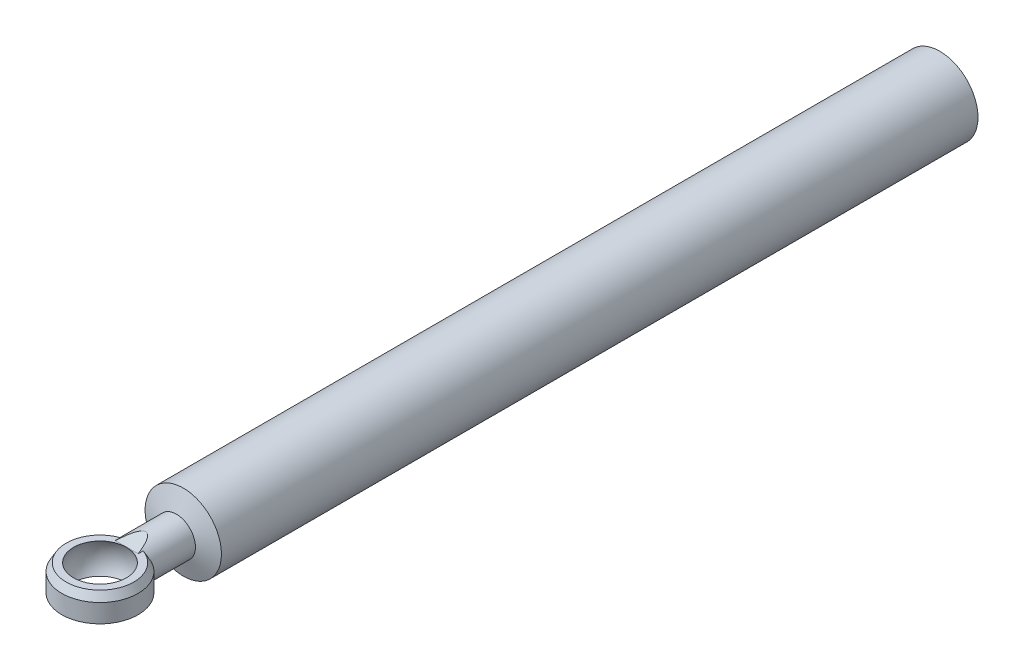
ISO-10303-21;
HEADER;
FILE_DESCRIPTION(('STEP AP214'),'2;1');
FILE_NAME('part.step','',(''),(''),'','','');
FILE_SCHEMA(('AUTOMOTIVE_DESIGN { 1 0 10303 214 1 1 1 1 }'));
ENDSEC;
DATA;
#1=APPLICATION_CONTEXT('core data for automotive mechanical design processes');
#2=APPLICATION_PROTOCOL_DEFINITION('international standard','automotive_design',2000,#1);
#3=PRODUCT_CONTEXT('',#1,'mechanical');
#4=PRODUCT('Part','Part','',(#3));
#5=PRODUCT_RELATED_PRODUCT_CATEGORY('part','',(#4));
#6=PRODUCT_DEFINITION_FORMATION('','',#4);
#7=PRODUCT_DEFINITION_CONTEXT('part definition',#1,'design');
#8=PRODUCT_DEFINITION('design','',#6,#7);
#9=PRODUCT_DEFINITION_SHAPE('','',#8);
#10=(LENGTH_UNIT() NAMED_UNIT(*) SI_UNIT(.MILLI.,.METRE.));
#11=(NAMED_UNIT(*) PLANE_ANGLE_UNIT() SI_UNIT($,.RADIAN.));
#12=(NAMED_UNIT(*) SI_UNIT($,.STERADIAN.) SOLID_ANGLE_UNIT());
#13=UNCERTAINTY_MEASURE_WITH_UNIT(LENGTH_MEASURE(1.E-05),#10,'distance_accuracy_value','');
#14=(GEOMETRIC_REPRESENTATION_CONTEXT(3) GLOBAL_UNCERTAINTY_ASSIGNED_CONTEXT((#13)) GLOBAL_UNIT_ASSIGNED_CONTEXT((#10,
#11,#12)) REPRESENTATION_CONTEXT('',''));
#15=CARTESIAN_POINT('',(0.,0.,0.));
#16=DIRECTION('',(0.,0.,1.));
#17=DIRECTION('',(1.,0.,0.));
#18=AXIS2_PLACEMENT_3D('',#15,#16,#17);
#19=CARTESIAN_POINT('',(-1.11022302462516E-13,4.,220.000000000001));
#20=DIRECTION('',(0.,1.,0.));
#21=DIRECTION('',(0.,0.,1.));
#22=AXIS2_PLACEMENT_3D('',#19,#20,#21);
#23=PLANE('',#22);
#24=CARTESIAN_POINT('',(-1.11022302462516E-13,4.,220.000000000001));
#25=DIRECTION('',(0.,1.,0.));
#26=DIRECTION('',(0.,0.,1.));
#27=AXIS2_PLACEMENT_3D('',#24,#25,#26);
#28=CIRCLE('',#27,8.84529946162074);
#29=CARTESIAN_POINT('',(-3.00000000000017,3.99999999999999,211.678983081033));
#30=VERTEX_POINT('',#29);
#31=CARTESIAN_POINT('',(3.00000000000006,4.,211.678983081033));
#32=VERTEX_POINT('',#31);
#33=EDGE_CURVE('E131',#30,#32,#28,.T.);
#34=ORIENTED_EDGE('',*,*,#33,.T.);
#35=DIRECTION('',(0.,0.,-1.));
#36=VECTOR('',#35,1.);
#37=CARTESIAN_POINT('',(2.99999999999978,4.,213.000000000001));
#38=LINE('',#37,#36);
#39=CARTESIAN_POINT('',(2.99999999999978,4.,213.000000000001));
#40=VERTEX_POINT('',#39);
#41=EDGE_CURVE('E110',#40,#32,#38,.T.);
#42=ORIENTED_EDGE('',*,*,#41,.F.);
#43=DIRECTION('',(-1.,0.,0.));
#44=VECTOR('',#43,1.);
#45=CARTESIAN_POINT('',(-1.11022302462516E-13,4.00000000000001,213.000000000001));
#46=LINE('',#45,#44);
#47=CARTESIAN_POINT('',(-3.00000000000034,3.99999999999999,213.));
#48=VERTEX_POINT('',#47);
#49=EDGE_CURVE('E95',#40,#48,#46,.T.);
#50=ORIENTED_EDGE('',*,*,#49,.T.);
#51=DIRECTION('',(0.,0.,-1.));
#52=VECTOR('',#51,1.);
#53=CARTESIAN_POINT('',(-3.00000000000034,3.99999999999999,213.));
#54=LINE('',#53,#52);
#55=EDGE_CURVE('E102',#30,#48,#54,.F.);
#56=ORIENTED_EDGE('',*,*,#55,.F.);
#57=EDGE_LOOP('',(#34,#42,#50,#56));
#58=FACE_BOUND('',#57,.T.);
#59=CARTESIAN_POINT('',(-1.11022302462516E-13,4.,220.000000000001));
#60=DIRECTION('',(0.,1.,0.));
#61=DIRECTION('',(0.,0.,1.));
#62=AXIS2_PLACEMENT_3D('',#59,#60,#61);
#63=CIRCLE('',#62,6.92820323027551);
#64=CARTESIAN_POINT('',(0.,4.,213.071796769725));
#65=VERTEX_POINT('',#64);
#66=EDGE_CURVE('E100',#65,#65,#63,.F.);
#67=ORIENTED_EDGE('',*,*,#66,.T.);
#68=EDGE_LOOP('',(#67));
#69=FACE_BOUND('',#68,.T.);
#70=ADVANCED_FACE('F31',(#58,#69),#23,.T.);
#71=CARTESIAN_POINT('',(1.11022302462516E-13,-4.,220.));
#72=DIRECTION('',(0.,1.,0.));
#73=DIRECTION('',(0.,0.,1.));
#74=AXIS2_PLACEMENT_3D('',#71,#72,#73);
#75=PLANE('',#74);
#76=CARTESIAN_POINT('',(1.11022302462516E-13,-4.,220.));
#77=DIRECTION('',(0.,1.,0.));
#78=DIRECTION('',(0.,0.,1.));
#79=AXIS2_PLACEMENT_3D('',#76,#77,#78);
#80=CIRCLE('',#79,8.00000000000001);
#81=CARTESIAN_POINT('',(3.00000000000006,-4.00000000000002,212.583801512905));
#82=VERTEX_POINT('',#81);
#83=CARTESIAN_POINT('',(-3.00000000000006,-3.99999999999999,212.583801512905));
#84=VERTEX_POINT('',#83);
#85=EDGE_CURVE('E47',#82,#84,#80,.F.);
#86=ORIENTED_EDGE('',*,*,#85,.T.);
#87=DIRECTION('',(0.,0.,-1.));
#88=VECTOR('',#87,1.);
#89=CARTESIAN_POINT('',(-2.99999999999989,-4.,213.000000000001));
#90=LINE('',#89,#88);
#91=CARTESIAN_POINT('',(-2.99999999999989,-4.,213.000000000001));
#92=VERTEX_POINT('',#91);
#93=EDGE_CURVE('E86',#84,#92,#90,.F.);
#94=ORIENTED_EDGE('',*,*,#93,.T.);
#95=DIRECTION('',(-1.,0.,0.));
#96=VECTOR('',#95,1.);
#97=CARTESIAN_POINT('',(1.66533453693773E-13,-3.99999999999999,213.000000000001));
#98=LINE('',#97,#96);
#99=CARTESIAN_POINT('',(2.99999999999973,-4.,213.000000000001));
#100=VERTEX_POINT('',#99);
#101=EDGE_CURVE('E93',#100,#92,#98,.T.);
#102=ORIENTED_EDGE('',*,*,#101,.F.);
#103=DIRECTION('',(0.,0.,-1.));
#104=VECTOR('',#103,1.);
#105=CARTESIAN_POINT('',(2.99999999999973,-4.,213.000000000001));
#106=LINE('',#105,#104);
#107=EDGE_CURVE('E88',#100,#82,#106,.T.);
#108=ORIENTED_EDGE('',*,*,#107,.T.);
#109=EDGE_LOOP('',(#86,#94,#102,#108));
#110=FACE_BOUND('',#109,.T.);
#111=CARTESIAN_POINT('',(1.11022302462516E-13,-4.,220.));
#112=DIRECTION('',(0.,1.,0.));
#113=DIRECTION('',(0.,0.,1.));
#114=AXIS2_PLACEMENT_3D('',#111,#112,#113);
#115=CIRCLE('',#114,6.92820323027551);
#116=CARTESIAN_POINT('',(0.,-4.,213.071796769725));
#117=VERTEX_POINT('',#116);
#118=EDGE_CURVE('E35',#117,#117,#115,.F.);
#119=ORIENTED_EDGE('',*,*,#118,.F.);
#120=EDGE_LOOP('',(#119));
#121=FACE_BOUND('',#120,.T.);
#122=ADVANCED_FACE('F98',(#110,#121),#75,.F.);
#123=CARTESIAN_POINT('',(-1.66533453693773E-13,0.,200.000000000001));
#124=DIRECTION('',(0.,0.,-1.));
#125=DIRECTION('',(-1.,0.,0.));
#126=AXIS2_PLACEMENT_3D('',#123,#124,#125);
#127=CYLINDRICAL_SURFACE('',#126,10.);
#128=CARTESIAN_POINT('',(0.,0.,198.18014882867));
#129=DIRECTION('',(0.,0.,1.));
#130=DIRECTION('',(1.,0.,0.));
#131=AXIS2_PLACEMENT_3D('',#128,#129,#130);
#132=CIRCLE('',#131,10.);
#133=CARTESIAN_POINT('',(9.99999999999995,0.,198.18014882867));
#134=VERTEX_POINT('',#133);
#135=EDGE_CURVE('E96',#134,#134,#132,.F.);
#136=ORIENTED_EDGE('',*,*,#135,.T.);
#137=EDGE_LOOP('',(#136));
#138=FACE_BOUND('',#137,.T.);
#139=CARTESIAN_POINT('',(0.,0.,0.));
#140=DIRECTION('',(0.,0.,1.));
#141=DIRECTION('',(1.,0.,0.));
#142=AXIS2_PLACEMENT_3D('',#139,#140,#141);
#143=CIRCLE('',#142,10.);
#144=CARTESIAN_POINT('',(10.,0.,0.));
#145=VERTEX_POINT('',#144);
#146=EDGE_CURVE('E116',#145,#145,#143,.T.);
#147=ORIENTED_EDGE('',*,*,#146,.T.);
#148=EDGE_LOOP('',(#147));
#149=FACE_BOUND('',#148,.T.);
#150=ADVANCED_FACE('F33',(#138,#149),#127,.T.);
#151=CARTESIAN_POINT('',(0.,0.,0.));
#152=DIRECTION('',(0.,0.,1.));
#153=DIRECTION('',(1.,0.,0.));
#154=AXIS2_PLACEMENT_3D('',#151,#152,#153);
#155=PLANE('',#154);
#156=ORIENTED_EDGE('',*,*,#146,.F.);
#157=EDGE_LOOP('',(#156));
#158=FACE_BOUND('',#157,.T.);
#159=ADVANCED_FACE('F148',(#158),#155,.F.);
#160=CARTESIAN_POINT('',(-1.11022302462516E-13,0.,213.000000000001));
#161=DIRECTION('',(0.,0.,-1.));
#162=DIRECTION('',(-1.,0.,0.));
#163=AXIS2_PLACEMENT_3D('',#160,#161,#162);
#164=CYLINDRICAL_SURFACE('',#163,5.);
#165=CARTESIAN_POINT('',(-2.22044604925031E-13,0.,233.000000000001));
#166=DIRECTION('',(0.,0.98058067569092,-0.196116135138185));
#167=DIRECTION('',(0.,-0.196116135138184,-0.980580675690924));
#168=AXIS2_PLACEMENT_3D('',#165,#166,#167);
#169=ELLIPSE('',#168,25.4950975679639,5.);
#170=EDGE_CURVE('E82',#100,#92,#169,.T.);
#171=ORIENTED_EDGE('',*,*,#170,.T.);
#172=ORIENTED_EDGE('',*,*,#93,.F.);
#173=CARTESIAN_POINT('',(-3.00000000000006,-3.99999999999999,212.583801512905));
#174=CARTESIAN_POINT('',(-3.06141518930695,-3.95393217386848,212.522582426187));
#175=CARTESIAN_POINT('',(-3.12064501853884,-3.90730690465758,212.459649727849));
#176=CARTESIAN_POINT('',(-3.23494374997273,-3.81321713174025,212.330782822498));
#177=CARTESIAN_POINT('',(-3.29001492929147,-3.76575310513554,212.264850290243));
#178=CARTESIAN_POINT('',(-3.44868855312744,-3.62308062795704,212.063990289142));
#179=CARTESIAN_POINT('',(-3.54656917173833,-3.52696621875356,211.925167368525));
#180=CARTESIAN_POINT('',(-3.72877947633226,-3.33374089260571,211.639830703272));
#181=CARTESIAN_POINT('',(-3.81311683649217,-3.2366305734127,211.493321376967));
#182=CARTESIAN_POINT('',(-3.93108170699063,-3.09039556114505,211.268651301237));
#183=CARTESIAN_POINT('',(-3.96909502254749,-3.04138700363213,211.192675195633));
#184=CARTESIAN_POINT('',(-4.04233000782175,-2.94334933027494,211.039427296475));
#185=CARTESIAN_POINT('',(-4.07755227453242,-2.89432022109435,210.962155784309));
#186=CARTESIAN_POINT('',(-4.11148038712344,-2.8452994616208,210.884314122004));
#187=B_SPLINE_CURVE_WITH_KNOTS('',3,(#173,#174,#175,#176,#177,#178,#179,#180,#181,#182,#183,
#184,#185,#186),.UNSPECIFIED.,.F.,.F.,(4,2,2,2,2,2,4),(0.,0.294478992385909,0.58879555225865,
1.17347314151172,1.75781824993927,2.05201049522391,2.34613964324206),.UNSPECIFIED.);
#188=CARTESIAN_POINT('',(-4.11148038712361,-2.84529946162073,210.884314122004));
#189=VERTEX_POINT('',#188);
#190=EDGE_CURVE('E11',#84,#189,#187,.T.);
#191=ORIENTED_EDGE('',*,*,#190,.T.);
#192=CARTESIAN_POINT('',(-4.99999999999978,0.,211.339745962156));
#193=CARTESIAN_POINT('',(-4.99999937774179,-0.130331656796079,211.339745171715));
#194=CARTESIAN_POINT('',(-4.99489703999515,-0.26067490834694,211.336793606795));
#195=CARTESIAN_POINT('',(-4.97455590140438,-0.520355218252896,211.325097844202));
#196=CARTESIAN_POINT('',(-4.95931238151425,-0.64969177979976,211.316350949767));
#197=CARTESIAN_POINT('',(-4.91885673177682,-0.906513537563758,211.293370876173));
#198=CARTESIAN_POINT('',(-4.89362896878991,-1.03399550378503,211.279129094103));
#199=CARTESIAN_POINT('',(-4.83352579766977,-1.28601746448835,211.245675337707));
#200=CARTESIAN_POINT('',(-4.79864619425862,-1.41055615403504,211.226461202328));
#201=CARTESIAN_POINT('',(-4.68053466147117,-1.77711120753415,211.162543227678));
#202=CARTESIAN_POINT('',(-4.58356144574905,-2.01373232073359,211.111401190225));
#203=CARTESIAN_POINT('',(-4.35632594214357,-2.46716195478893,210.997863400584));
#204=CARTESIAN_POINT('',(-4.22606185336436,-2.68396940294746,210.935467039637));
#205=CARTESIAN_POINT('',(-3.92334549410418,-3.11151061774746,210.800159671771));
#206=CARTESIAN_POINT('',(-3.74829976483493,-3.32026858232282,210.726805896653));
#207=CARTESIAN_POINT('',(-3.36622943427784,-3.70706905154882,210.581391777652));
#208=CARTESIAN_POINT('',(-3.15918897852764,-3.88509623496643,210.509332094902));
#209=CARTESIAN_POINT('',(-2.82033206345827,-4.13122642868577,210.40515556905));
#210=CARTESIAN_POINT('',(-2.69838192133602,-4.21191315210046,210.370064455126));
#211=CARTESIAN_POINT('',(-2.4472213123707,-4.36262866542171,210.30319843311));
#212=CARTESIAN_POINT('',(-2.31801376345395,-4.43266169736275,210.271422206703));
#213=CARTESIAN_POINT('',(-2.05317391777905,-4.56137623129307,210.212104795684));
#214=CARTESIAN_POINT('',(-1.91754328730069,-4.62006065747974,210.184562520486));
#215=CARTESIAN_POINT('',(-1.64079696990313,-4.72543101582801,210.13452757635));
#216=CARTESIAN_POINT('',(-1.49968186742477,-4.77211822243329,210.11203437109));
#217=CARTESIAN_POINT('',(-1.22330436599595,-4.85001551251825,210.074196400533));
#218=CARTESIAN_POINT('',(-1.08833937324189,-4.88209010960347,210.058457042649));
#219=CARTESIAN_POINT('',(-0.815709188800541,-4.93496642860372,210.032384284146));
#220=CARTESIAN_POINT('',(-0.678044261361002,-4.95576924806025,210.022050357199));
#221=CARTESIAN_POINT('',(-0.401217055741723,-4.98581991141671,210.007090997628));
#222=CARTESIAN_POINT('',(-0.262055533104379,-4.99507333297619,210.002462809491));
#223=CARTESIAN_POINT('',(0.0166220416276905,-5.00191433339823,209.999043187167));
#224=CARTESIAN_POINT('',(0.156138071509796,-4.99950262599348,210.000251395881));
#225=CARTESIAN_POINT('',(0.422158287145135,-4.98376939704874,210.008107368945));
#226=CARTESIAN_POINT('',(0.54873556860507,-4.97141822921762,210.014271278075));
#227=CARTESIAN_POINT('',(0.800312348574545,-4.93716742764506,210.03127884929));
#228=CARTESIAN_POINT('',(0.925311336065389,-4.915264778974,210.042123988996));
#229=CARTESIAN_POINT('',(1.17280363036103,-4.86215377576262,210.068232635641));
#230=CARTESIAN_POINT('',(1.29529776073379,-4.83094853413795,210.08349466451));
#231=CARTESIAN_POINT('',(1.53706747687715,-4.7595523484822,210.118078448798));
#232=CARTESIAN_POINT('',(1.65634181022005,-4.71935796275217,210.137401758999));
#233=CARTESIAN_POINT('',(2.01140340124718,-4.58462546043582,210.201407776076));
#234=CARTESIAN_POINT('',(2.24122720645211,-4.47663104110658,210.251773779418));
#235=CARTESIAN_POINT('',(2.67992393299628,-4.22867030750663,210.363121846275));
#236=CARTESIAN_POINT('',(2.88878931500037,-4.088692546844,210.424107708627));
#237=CARTESIAN_POINT('',(3.30085071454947,-3.76553652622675,210.557776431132));
#238=CARTESIAN_POINT('',(3.50164452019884,-3.57952539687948,210.631020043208));
#239=CARTESIAN_POINT('',(3.8705477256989,-3.17701080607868,210.77729413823));
#240=CARTESIAN_POINT('',(4.03863197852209,-2.96048410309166,210.850324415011));
#241=CARTESIAN_POINT('',(4.26795395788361,-2.60880646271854,210.956090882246));
#242=CARTESIAN_POINT('',(4.34240098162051,-2.48294906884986,210.991700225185));
#243=CARTESIAN_POINT('',(4.48030007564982,-2.22448612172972,211.059485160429));
#244=CARTESIAN_POINT('',(4.54375677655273,-2.09188344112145,211.091662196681));
#245=CARTESIAN_POINT('',(4.65901104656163,-1.82079650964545,211.151393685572));
#246=CARTESIAN_POINT('',(4.71081567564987,-1.68231588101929,211.178950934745));
#247=CARTESIAN_POINT('',(4.80217514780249,-1.40037865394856,211.228351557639));
#248=CARTESIAN_POINT('',(4.84173166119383,-1.25692273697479,211.250195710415));
#249=CARTESIAN_POINT('',(4.90539138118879,-0.9777430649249,211.285738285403));
#250=CARTESIAN_POINT('',(4.9304700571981,-0.842306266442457,211.299944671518));
#251=CARTESIAN_POINT('',(4.96939299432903,-0.569328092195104,211.322117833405));
#252=CARTESIAN_POINT('',(4.98323863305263,-0.431786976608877,211.330085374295));
#253=CARTESIAN_POINT('',(4.99947854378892,-0.155884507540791,211.339439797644));
#254=CARTESIAN_POINT('',(5.00187935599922,-0.0175236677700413,211.340830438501));
#255=CARTESIAN_POINT('',(4.99520900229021,0.258820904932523,211.336980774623));
#256=CARTESIAN_POINT('',(4.98613861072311,0.396804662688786,211.331740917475));
#257=CARTESIAN_POINT('',(4.95828928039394,0.656088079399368,211.315784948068));
#258=CARTESIAN_POINT('',(4.94068517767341,0.777556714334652,211.305733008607));
#259=CARTESIAN_POINT('',(4.89671673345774,1.01841757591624,211.28089501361));
#260=CARTESIAN_POINT('',(4.87034969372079,1.13780915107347,211.266107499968));
#261=CARTESIAN_POINT('',(4.77850297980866,1.49171004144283,211.215303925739));
#262=CARTESIAN_POINT('',(4.70025914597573,1.72211429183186,211.172835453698));
#263=CARTESIAN_POINT('',(4.50823244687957,2.17709323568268,211.073187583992));
#264=CARTESIAN_POINT('',(4.39297142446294,2.4009036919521,211.015417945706));
#265=CARTESIAN_POINT('',(4.13143421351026,2.82733774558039,210.892193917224));
#266=CARTESIAN_POINT('',(3.98514209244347,3.02995037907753,210.826735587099));
#267=CARTESIAN_POINT('',(3.64419701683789,3.43489140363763,210.685602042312));
#268=CARTESIAN_POINT('',(3.44577250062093,3.63396448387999,210.60967906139));
#269=CARTESIAN_POINT('',(3.01697632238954,3.99708246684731,210.463280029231));
#270=CARTESIAN_POINT('',(2.7865939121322,4.16111553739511,210.392805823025));
#271=CARTESIAN_POINT('',(2.41774074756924,4.37900947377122,210.295805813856));
#272=CARTESIAN_POINT('',(2.28903769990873,4.44766209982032,210.264570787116));
#273=CARTESIAN_POINT('',(2.02535752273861,4.57375651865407,210.20632288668));
#274=CARTESIAN_POINT('',(1.89038320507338,4.63120327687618,210.179308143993));
#275=CARTESIAN_POINT('',(1.61516754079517,4.73421790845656,210.13031059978));
#276=CARTESIAN_POINT('',(1.47492874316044,4.77979144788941,210.108325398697));
#277=CARTESIAN_POINT('',(1.19024723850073,4.85850907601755,210.070049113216));
#278=CARTESIAN_POINT('',(1.04580503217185,4.89165463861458,210.053757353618));
#279=CARTESIAN_POINT('',(0.767401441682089,4.94259503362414,210.028600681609));
#280=CARTESIAN_POINT('',(0.633694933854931,4.96151960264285,210.019191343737));
#281=CARTESIAN_POINT('',(0.364924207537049,4.98849345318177,210.005755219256));
#282=CARTESIAN_POINT('',(0.229860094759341,4.99654357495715,210.001728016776));
#283=CARTESIAN_POINT('',(-0.0404881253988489,5.00166317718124,209.999168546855));
#284=CARTESIAN_POINT('',(-0.175772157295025,4.99873585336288,210.000634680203));
#285=CARTESIAN_POINT('',(-0.44548523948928,4.98194745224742,210.00901666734));
#286=CARTESIAN_POINT('',(-0.579914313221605,4.9680866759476,210.015932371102));
#287=CARTESIAN_POINT('',(-0.838004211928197,4.93088232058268,210.03439129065));
#288=CARTESIAN_POINT('',(-0.961788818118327,4.90822716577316,210.045597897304));
#289=CARTESIAN_POINT('',(-1.20687032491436,4.85378684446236,210.072326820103));
#290=CARTESIAN_POINT('',(-1.32816642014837,4.82199877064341,210.08785051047));
#291=CARTESIAN_POINT('',(-1.68709586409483,4.71339175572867,210.140387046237));
#292=CARTESIAN_POINT('',(-1.91998814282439,4.62329807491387,210.183381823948));
#293=CARTESIAN_POINT('',(-2.37715486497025,4.40635777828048,210.283705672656));
#294=CARTESIAN_POINT('',(-2.60063468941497,4.27810403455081,210.341569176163));
#295=CARTESIAN_POINT('',(-3.02386422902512,3.99020969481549,210.465593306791));
#296=CARTESIAN_POINT('',(-3.22360297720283,3.83055468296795,210.531757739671));
#297=CARTESIAN_POINT('',(-3.61456788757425,3.4660248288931,210.673567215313));
#298=CARTESIAN_POINT('',(-3.80296860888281,3.25823096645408,210.749500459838));
#299=CARTESIAN_POINT('',(-4.14333626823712,2.81270295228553,210.896855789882));
#300=CARTESIAN_POINT('',(-4.29527097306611,2.57494259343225,210.968273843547));
#301=CARTESIAN_POINT('',(-4.49442606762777,2.19578033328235,211.066587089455));
#302=CARTESIAN_POINT('',(-4.5567568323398,2.06337367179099,211.098313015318));
#303=CARTESIAN_POINT('',(-4.66985426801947,1.79274453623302,211.157120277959));
#304=CARTESIAN_POINT('',(-4.72062689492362,1.65452510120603,211.184204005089));
#305=CARTESIAN_POINT('',(-4.80987708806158,1.3735921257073,211.232579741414));
#306=CARTESIAN_POINT('',(-4.84838628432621,1.23089120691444,211.253886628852));
#307=CARTESIAN_POINT('',(-4.91270711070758,0.941907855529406,211.28985215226));
#308=CARTESIAN_POINT('',(-4.93852761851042,0.795628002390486,211.304515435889));
#309=CARTESIAN_POINT('',(-4.97182308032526,0.541002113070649,211.323524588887));
#310=CARTESIAN_POINT('',(-4.98237929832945,0.433175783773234,211.329592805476));
#311=CARTESIAN_POINT('',(-4.99646825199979,0.216902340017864,211.337703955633));
#312=CARTESIAN_POINT('',(-5.00000051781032,0.108455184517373,211.33974661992));
#313=CARTESIAN_POINT('',(-4.99999999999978,0.,211.339745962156));
#314=B_SPLINE_CURVE_WITH_KNOTS('',3,(#192,#193,#194,#195,#196,#197,#198,#199,#200,#201,#202,
#203,#204,#205,#206,#207,#208,#209,#210,#211,#212,#213,#214,#215,#216,#217,#218,#219,#220,#221,
#222,#223,#224,#225,#226,#227,#228,#229,#230,#231,#232,#233,#234,#235,#236,#237,#238,#239,#240,
#241,#242,#243,#244,#245,#246,#247,#248,#249,#250,#251,#252,#253,#254,#255,#256,#257,#258,#259,
#260,#261,#262,#263,#264,#265,#266,#267,#268,#269,#270,#271,#272,#273,#274,#275,#276,#277,#278,
#279,#280,#281,#282,#283,#284,#285,#286,#287,#288,#289,#290,#291,#292,#293,#294,#295,#296,#297,
#298,#299,#300,#301,#302,#303,#304,#305,#306,#307,#308,#309,#310,#311,#312,#313),.UNSPECIFIED.,
.T.,.F.,(4,2,2,2,2,2,2,2,2,2,2,2,2,2,2,2,2,2,2,2,2,2,2,2,2,2,2,2,2,2,2,2,2,2,2,2,2,2,2,2,2,2,2,
2,2,2,2,2,2,2,2,2,2,2,2,2,2,2,2,2,4),(0.,0.39088238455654,0.781946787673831,1.17362595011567,
1.56547562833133,2.34415414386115,3.12287479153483,3.96582272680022,4.8091897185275,
5.25982992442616,5.71029022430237,6.1606342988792,6.61093051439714,7.02920538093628,
7.44743951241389,7.86547158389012,8.28347807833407,8.66500933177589,9.04666110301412,
9.42818530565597,9.80985583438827,10.5829669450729,11.3563551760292,12.202849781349,
13.0499926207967,13.5010020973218,13.9518210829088,14.4023661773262,14.8528498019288,
15.2676702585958,15.6824398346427,16.0969723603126,16.5114769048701,16.8804871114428,
17.2496110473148,17.9873544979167,18.7592666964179,19.531576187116,20.4012390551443,
21.2711951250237,21.7182117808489,22.1650299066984,22.6116344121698,23.0581859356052,
23.4637505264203,23.8692837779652,24.2746989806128,24.6801030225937,25.0586722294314,
25.4373620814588,26.1940875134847,26.9831783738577,27.77263234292,28.6406529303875,
29.509437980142,29.9581473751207,30.4066250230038,30.8539364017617,31.3009343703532,
31.626184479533,31.9514563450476),.UNSPECIFIED.);
#315=CARTESIAN_POINT('',(-4.58257569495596,1.99999999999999,211.111805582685));
#316=VERTEX_POINT('',#315);
#317=EDGE_CURVE('E123',#316,#189,#314,.T.);
#318=ORIENTED_EDGE('',*,*,#317,.F.);
#319=CARTESIAN_POINT('',(-4.58257569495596,1.99999999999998,211.111805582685));
#320=CARTESIAN_POINT('',(-4.53414774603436,2.11101340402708,211.15897430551));
#321=CARTESIAN_POINT('',(-4.48120318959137,2.22127150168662,211.203350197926));
#322=CARTESIAN_POINT('',(-4.36633843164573,2.43930863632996,211.286338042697));
#323=CARTESIAN_POINT('',(-4.30441476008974,2.5470866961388,211.3249477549));
#324=CARTESIAN_POINT('',(-4.17330081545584,2.75652976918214,211.395321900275));
#325=CARTESIAN_POINT('',(-4.10432386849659,2.85827970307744,211.427229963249));
#326=CARTESIAN_POINT('',(-3.95824430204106,3.05737702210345,211.485404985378));
#327=CARTESIAN_POINT('',(-3.88114481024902,3.15472608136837,211.51167410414));
#328=CARTESIAN_POINT('',(-3.68315376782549,3.38625323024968,211.569313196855));
#329=CARTESIAN_POINT('',(-3.55801951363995,3.51758861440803,211.597767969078));
#330=CARTESIAN_POINT('',(-3.35833335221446,3.70542654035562,211.633288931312));
#331=CARTESIAN_POINT('',(-3.28909650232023,3.76702189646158,211.643998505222));
#332=CARTESIAN_POINT('',(-3.14712017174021,3.88641621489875,211.663135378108));
#333=CARTESIAN_POINT('',(-3.07438065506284,3.94421513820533,211.671562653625));
#334=CARTESIAN_POINT('',(-3.00000000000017,3.99999999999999,211.678983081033));
#335=B_SPLINE_CURVE_WITH_KNOTS('',3,(#319,#320,#321,#322,#323,#324,#325,#326,#327,#328,#329,
#330,#331,#332,#333,#334),.UNSPECIFIED.,.F.,.F.,(4,2,2,2,2,2,2,4),(0.,0.389859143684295,
0.77986935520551,1.16039539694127,1.5407754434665,2.0900732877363,2.36979131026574,
2.64951220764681),.UNSPECIFIED.);
#336=EDGE_CURVE('E176',#316,#30,#335,.T.);
#337=ORIENTED_EDGE('',*,*,#336,.T.);
#338=ORIENTED_EDGE('',*,*,#55,.T.);
#339=CARTESIAN_POINT('',(-2.22044604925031E-13,0.,233.000000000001));
#340=DIRECTION('',(0.,-0.980580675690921,-0.196116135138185));
#341=DIRECTION('',(0.,0.196116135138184,-0.980580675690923));
#342=AXIS2_PLACEMENT_3D('',#339,#340,#341);
#343=ELLIPSE('',#342,25.4950975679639,5.);
#344=EDGE_CURVE('E91',#48,#40,#343,.T.);
#345=ORIENTED_EDGE('',*,*,#344,.T.);
#346=ORIENTED_EDGE('',*,*,#41,.T.);
#347=CARTESIAN_POINT('',(3.00000000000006,4.,211.678983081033));
#348=CARTESIAN_POINT('',(3.10367242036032,3.92227591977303,211.66866044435));
#349=CARTESIAN_POINT('',(3.20417957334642,3.84057047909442,211.656344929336));
#350=CARTESIAN_POINT('',(3.39823136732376,3.66996676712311,211.627084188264));
#351=CARTESIAN_POINT('',(3.49177349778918,3.58106592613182,211.610137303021));
#352=CARTESIAN_POINT('',(3.66900516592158,3.39913880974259,211.571452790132));
#353=CARTESIAN_POINT('',(3.75287905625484,3.30626554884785,211.549841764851));
#354=CARTESIAN_POINT('',(3.91276888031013,3.11540414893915,211.501217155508));
#355=CARTESIAN_POINT('',(3.98878781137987,3.0174179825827,211.474205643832));
#356=CARTESIAN_POINT('',(4.16459911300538,2.77268094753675,211.401237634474));
#357=CARTESIAN_POINT('',(4.25995091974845,2.62360381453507,211.352195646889));
#358=CARTESIAN_POINT('',(4.39034280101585,2.39433533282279,211.269362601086));
#359=CARTESIAN_POINT('',(4.43201590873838,2.3162433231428,211.239899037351));
#360=CARTESIAN_POINT('',(4.51074804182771,2.15890728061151,211.178033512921));
#361=CARTESIAN_POINT('',(4.54780719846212,2.07966328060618,211.145631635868));
#362=CARTESIAN_POINT('',(4.58257569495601,1.99999999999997,211.111805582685));
#363=B_SPLINE_CURVE_WITH_KNOTS('',3,(#347,#348,#349,#350,#351,#352,#353,#354,#355,#356,#357,
#358,#359,#360,#361,#362),.UNSPECIFIED.,.F.,.F.,(4,2,2,2,2,2,2,4),(0.,0.389857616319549,
0.779855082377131,1.1603630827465,1.54072534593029,2.09005455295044,2.36978652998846,
2.64951054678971),.UNSPECIFIED.);
#364=CARTESIAN_POINT('',(4.58257569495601,1.99999999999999,211.111805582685));
#365=VERTEX_POINT('',#364);
#366=EDGE_CURVE('E177',#32,#365,#363,.T.);
#367=ORIENTED_EDGE('',*,*,#366,.T.);
#368=CARTESIAN_POINT('',(4.11148038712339,-2.84529946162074,210.884314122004));
#369=VERTEX_POINT('',#368);
#370=EDGE_CURVE('E130',#369,#365,#314,.T.);
#371=ORIENTED_EDGE('',*,*,#370,.F.);
#372=CARTESIAN_POINT('',(4.11148038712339,-2.84529946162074,210.884314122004));
#373=CARTESIAN_POINT('',(4.07755227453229,-2.89432022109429,210.962155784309));
#374=CARTESIAN_POINT('',(4.04233000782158,-2.94334933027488,211.039427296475));
#375=CARTESIAN_POINT('',(3.9690950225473,-3.04138700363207,211.192675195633));
#376=CARTESIAN_POINT('',(3.93108170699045,-3.09039556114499,211.268651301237));
#377=CARTESIAN_POINT('',(3.81311683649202,-3.23663057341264,211.493321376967));
#378=CARTESIAN_POINT('',(3.7287794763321,-3.33374089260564,211.639830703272));
#379=CARTESIAN_POINT('',(3.54656917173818,-3.52696621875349,211.925167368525));
#380=CARTESIAN_POINT('',(3.4486885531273,-3.62308062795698,212.063990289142));
#381=CARTESIAN_POINT('',(3.29001492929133,-3.76575310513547,212.264850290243));
#382=CARTESIAN_POINT('',(3.23494374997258,-3.81321713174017,212.330782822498));
#383=CARTESIAN_POINT('',(3.12064501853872,-3.90730690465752,212.459649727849));
#384=CARTESIAN_POINT('',(3.06141518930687,-3.95393217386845,212.522582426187));
#385=CARTESIAN_POINT('',(3.00000000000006,-4.00000000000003,212.583801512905));
#386=B_SPLINE_CURVE_WITH_KNOTS('',3,(#372,#373,#374,#375,#376,#377,#378,#379,#380,#381,#382,
#383,#384,#385),.UNSPECIFIED.,.F.,.F.,(4,2,2,2,2,2,4),(0.,0.294129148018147,0.588321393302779,
1.17266650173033,1.75734409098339,2.05166065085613,2.34613964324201),.UNSPECIFIED.);
#387=EDGE_CURVE('E40',#369,#82,#386,.T.);
#388=ORIENTED_EDGE('',*,*,#387,.T.);
#389=ORIENTED_EDGE('',*,*,#107,.F.);
#390=EDGE_LOOP('',(#171,#172,#191,#318,#337,#338,#345,#346,#367,#371,#388,#389));
#391=FACE_BOUND('',#390,.T.);
#392=CARTESIAN_POINT('',(-1.66533453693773E-13,0.,200.000000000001));
#393=DIRECTION('',(0.,0.,1.));
#394=DIRECTION('',(1.,0.,0.));
#395=AXIS2_PLACEMENT_3D('',#392,#393,#394);
#396=CIRCLE('',#395,5.);
#397=CARTESIAN_POINT('',(4.99999999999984,0.,200.000000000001));
#398=VERTEX_POINT('',#397);
#399=EDGE_CURVE('E113',#398,#398,#396,.T.);
#400=ORIENTED_EDGE('',*,*,#399,.T.);
#401=EDGE_LOOP('',(#400));
#402=FACE_BOUND('',#401,.T.);
#403=ADVANCED_FACE('F84',(#391,#402),#164,.T.);
#404=CARTESIAN_POINT('',(-1.66533453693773E-13,0.,200.000000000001));
#405=DIRECTION('',(0.,0.,-1.));
#406=DIRECTION('',(-1.,0.,0.));
#407=AXIS2_PLACEMENT_3D('',#404,#405,#406);
#408=CONICAL_SURFACE('',#407,4.99999999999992,1.22173047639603);
#409=ORIENTED_EDGE('',*,*,#135,.F.);
#410=EDGE_LOOP('',(#409));
#411=FACE_BOUND('',#410,.T.);
#412=ORIENTED_EDGE('',*,*,#399,.F.);
#413=EDGE_LOOP('',(#412));
#414=FACE_BOUND('',#413,.T.);
#415=ADVANCED_FACE('F140',(#411,#414),#408,.T.);
#416=CARTESIAN_POINT('',(-1.11022302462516E-13,4.,220.000000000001));
#417=DIRECTION('',(0.,-1.,0.));
#418=DIRECTION('',(0.,0.,-1.));
#419=AXIS2_PLACEMENT_3D('',#416,#417,#418);
#420=CYLINDRICAL_SURFACE('',#419,10.);
#421=ORIENTED_EDGE('',*,*,#370,.T.);
#422=CARTESIAN_POINT('',(-1.11022302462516E-13,2.00000000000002,220.));
#423=DIRECTION('',(0.,1.,0.));
#424=DIRECTION('',(0.,0.,1.));
#425=AXIS2_PLACEMENT_3D('',#422,#423,#424);
#426=CIRCLE('',#425,10.);
#427=EDGE_CURVE('E180',#365,#316,#426,.F.);
#428=ORIENTED_EDGE('',*,*,#427,.T.);
#429=ORIENTED_EDGE('',*,*,#317,.T.);
#430=CARTESIAN_POINT('',(-2.22044604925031E-13,-2.84529946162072,220.000000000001));
#431=DIRECTION('',(0.,1.,0.));
#432=DIRECTION('',(0.,0.,1.));
#433=AXIS2_PLACEMENT_3D('',#430,#431,#432);
#434=CIRCLE('',#433,10.);
#435=EDGE_CURVE('E178',#189,#369,#434,.T.);
#436=ORIENTED_EDGE('',*,*,#435,.T.);
#437=EDGE_LOOP('',(#421,#428,#429,#436));
#438=FACE_BOUND('',#437,.T.);
#439=ADVANCED_FACE('F135',(#438),#420,.T.);
#440=CARTESIAN_POINT('',(-1.11022302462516E-13,4.,220.000000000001));
#441=DIRECTION('',(0.,-1.,0.));
#442=DIRECTION('',(0.,0.,-1.));
#443=AXIS2_PLACEMENT_3D('',#440,#441,#442);
#444=CONICAL_SURFACE('',#443,8.84529946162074,0.523598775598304);
#445=ORIENTED_EDGE('',*,*,#336,.F.);
#446=ORIENTED_EDGE('',*,*,#427,.F.);
#447=ORIENTED_EDGE('',*,*,#366,.F.);
#448=ORIENTED_EDGE('',*,*,#33,.F.);
#449=EDGE_LOOP('',(#445,#446,#447,#448));
#450=FACE_BOUND('',#449,.T.);
#451=ADVANCED_FACE('F139',(#450),#444,.T.);
#452=CARTESIAN_POINT('',(-2.22044604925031E-13,-2.84529946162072,220.000000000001));
#453=DIRECTION('',(0.,1.,0.));
#454=DIRECTION('',(0.,0.,1.));
#455=AXIS2_PLACEMENT_3D('',#452,#453,#454);
#456=CONICAL_SURFACE('',#455,10.,1.0471975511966);
#457=ORIENTED_EDGE('',*,*,#190,.F.);
#458=ORIENTED_EDGE('',*,*,#85,.F.);
#459=ORIENTED_EDGE('',*,*,#387,.F.);
#460=ORIENTED_EDGE('',*,*,#435,.F.);
#461=EDGE_LOOP('',(#457,#458,#459,#460));
#462=FACE_BOUND('',#461,.T.);
#463=ADVANCED_FACE('F167',(#462),#456,.T.);
#464=CARTESIAN_POINT('',(0.,0.,220.000000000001));
#465=DIRECTION('',(0.,1.,0.));
#466=DIRECTION('',(0.,0.,-1.));
#467=AXIS2_PLACEMENT_3D('',#464,#465,#466);
#468=SPHERICAL_SURFACE('',#467,8.);
#469=CARTESIAN_POINT('',(0.,4.,213.071796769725));
#470=CARTESIAN_POINT('',(0.,3.92442528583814,213.028163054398));
#471=CARTESIAN_POINT('',(0.,3.84813611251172,212.985766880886));
#472=CARTESIAN_POINT('',(0.,3.69421167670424,212.903492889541));
#473=CARTESIAN_POINT('',(0.,3.61657641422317,212.863615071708));
#474=CARTESIAN_POINT('',(0.,3.46004262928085,212.78642106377));
#475=CARTESIAN_POINT('',(0.,3.38114410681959,212.749104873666));
#476=CARTESIAN_POINT('',(0.,3.22216837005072,212.677073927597));
#477=CARTESIAN_POINT('',(0.,3.1420911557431,212.642359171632));
#478=CARTESIAN_POINT('',(0.,2.98084376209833,212.575568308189));
#479=CARTESIAN_POINT('',(0.,2.89967358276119,212.54349220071));
#480=CARTESIAN_POINT('',(0.,2.73632718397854,212.482012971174));
#481=CARTESIAN_POINT('',(0.,2.65415096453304,212.452609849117));
#482=CARTESIAN_POINT('',(0.,2.48888048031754,212.396508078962));
#483=CARTESIAN_POINT('',(0.,2.40578621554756,212.369809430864));
#484=CARTESIAN_POINT('',(0.,2.23876862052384,212.319145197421));
#485=CARTESIAN_POINT('',(0.,2.1548452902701,212.295179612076));
#486=CARTESIAN_POINT('',(0.,1.98625943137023,212.250007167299));
#487=CARTESIAN_POINT('',(0.,1.90159690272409,212.228800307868));
#488=CARTESIAN_POINT('',(0.,1.73162330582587,212.189168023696));
#489=CARTESIAN_POINT('',(0.,1.64631223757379,212.170742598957));
#490=CARTESIAN_POINT('',(0.,1.47513291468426,212.136692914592));
#491=CARTESIAN_POINT('',(0.,1.38926466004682,212.121068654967));
#492=CARTESIAN_POINT('',(0.,1.21706291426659,212.092638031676));
#493=CARTESIAN_POINT('',(0.,1.1307294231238,212.079831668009));
#494=CARTESIAN_POINT('',(0.,0.957689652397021,212.057050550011));
#495=CARTESIAN_POINT('',(0.,0.87098337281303,212.047075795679));
#496=CARTESIAN_POINT('',(0.,0.697290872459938,212.029968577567));
#497=CARTESIAN_POINT('',(0.,0.610304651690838,212.022836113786));
#498=CARTESIAN_POINT('',(0.,0.436145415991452,212.011421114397));
#499=CARTESIAN_POINT('',(0.,0.348972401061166,212.007138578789));
#500=CARTESIAN_POINT('',(0.,0.174532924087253,212.00142802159));
#501=CARTESIAN_POINT('',(0.,0.087266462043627,212.000000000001));
#502=CARTESIAN_POINT('',(0.,-0.0872664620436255,212.000000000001));
#503=CARTESIAN_POINT('',(0.,-0.174532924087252,212.00142802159));
#504=CARTESIAN_POINT('',(0.,-0.348972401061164,212.007138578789));
#505=CARTESIAN_POINT('',(0.,-0.43614541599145,212.011421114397));
#506=CARTESIAN_POINT('',(0.,-0.610304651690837,212.022836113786));
#507=CARTESIAN_POINT('',(0.,-0.697290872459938,212.029968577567));
#508=CARTESIAN_POINT('',(0.,-0.870983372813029,212.047075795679));
#509=CARTESIAN_POINT('',(0.,-0.95768965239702,212.057050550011));
#510=CARTESIAN_POINT('',(0.,-1.1307294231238,212.079831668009));
#511=CARTESIAN_POINT('',(0.,-1.21706291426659,212.092638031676));
#512=CARTESIAN_POINT('',(0.,-1.38926466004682,212.121068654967));
#513=CARTESIAN_POINT('',(0.,-1.47513291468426,212.136692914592));
#514=CARTESIAN_POINT('',(0.,-1.64631223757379,212.170742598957));
#515=CARTESIAN_POINT('',(0.,-1.73162330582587,212.189168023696));
#516=CARTESIAN_POINT('',(0.,-1.90159690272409,212.228800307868));
#517=CARTESIAN_POINT('',(0.,-1.98625943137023,212.250007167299));
#518=CARTESIAN_POINT('',(0.,-2.1548452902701,212.295179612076));
#519=CARTESIAN_POINT('',(0.,-2.23876862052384,212.319145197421));
#520=CARTESIAN_POINT('',(0.,-2.40578621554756,212.369809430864));
#521=CARTESIAN_POINT('',(0.,-2.48888048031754,212.396508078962));
#522=CARTESIAN_POINT('',(0.,-2.65415096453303,212.452609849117));
#523=CARTESIAN_POINT('',(0.,-2.73632718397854,212.482012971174));
#524=CARTESIAN_POINT('',(0.,-2.89967358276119,212.54349220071));
#525=CARTESIAN_POINT('',(0.,-2.98084376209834,212.575568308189));
#526=CARTESIAN_POINT('',(0.,-3.1420911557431,212.642359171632));
#527=CARTESIAN_POINT('',(0.,-3.22216837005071,212.677073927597));
#528=CARTESIAN_POINT('',(0.,-3.38114410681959,212.749104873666));
#529=CARTESIAN_POINT('',(0.,-3.46004262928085,212.78642106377));
#530=CARTESIAN_POINT('',(0.,-3.61657641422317,212.863615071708));
#531=CARTESIAN_POINT('',(0.,-3.69421167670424,212.903492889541));
#532=CARTESIAN_POINT('',(0.,-3.84813611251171,212.985766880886));
#533=CARTESIAN_POINT('',(0.,-3.92442528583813,213.028163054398));
#534=CARTESIAN_POINT('',(0.,-4.,213.071796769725));
#535=B_SPLINE_CURVE_WITH_KNOTS('',3,(#469,#470,#471,#472,#473,#474,#475,#476,#477,#478,#479,
#480,#481,#482,#483,#484,#485,#486,#487,#488,#489,#490,#491,#492,#493,#494,#495,#496,#497,#498,
#499,#500,#501,#502,#503,#504,#505,#506,#507,#508,#509,#510,#511,#512,#513,#514,#515,#516,#517,
#518,#519,#520,#521,#522,#523,#524,#525,#526,#527,#528,#529,#530,#531,#532,#533,#534),
.UNSPECIFIED.,.F.,.F.,(4,2,2,2,2,2,2,2,2,2,2,2,2,2,2,2,2,2,2,2,2,2,2,2,2,2,2,2,2,2,2,2,4),(0.,
0.261787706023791,0.523575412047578,0.785363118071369,1.04715082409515,1.30893853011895,
1.57072623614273,1.83251394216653,2.09430164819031,2.3560893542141,2.61787706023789,
2.87966476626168,3.14145247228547,3.40324017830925,3.66502788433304,3.92681559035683,
4.18860329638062,4.45039100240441,4.71217870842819,4.97396641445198,5.23575412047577,
5.49754182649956,5.75932953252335,6.02111723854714,6.28290494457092,6.54469265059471,
6.8064803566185,7.06826806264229,7.33005576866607,7.59184347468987,7.85363118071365,
8.11541888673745,8.37720659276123),.UNSPECIFIED.);
#536=EDGE_CURVE('BSEAM163',#65,#117,#535,.T.);
#537=ORIENTED_EDGE('',*,*,#66,.F.);
#538=ORIENTED_EDGE('',*,*,#118,.T.);
#539=ORIENTED_EDGE('',*,*,#536,.T.);
#540=ORIENTED_EDGE('',*,*,#536,.F.);
#541=EDGE_LOOP('',(#537,#539,#538,#540));
#542=FACE_BOUND('',#541,.T.);
#543=ADVANCED_FACE('F163',(#542),#468,.F.);
#544=CARTESIAN_POINT('',(-10.0000000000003,3.99999999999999,213.000000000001));
#545=DIRECTION('',(0.,-0.980580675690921,-0.196116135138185));
#546=DIRECTION('',(0.,0.196116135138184,-0.980580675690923));
#547=AXIS2_PLACEMENT_3D('',#544,#545,#546);
#548=PLANE('',#547);
#549=ORIENTED_EDGE('',*,*,#344,.F.);
#550=ORIENTED_EDGE('',*,*,#49,.F.);
#551=EDGE_LOOP('',(#549,#550));
#552=FACE_BOUND('',#551,.T.);
#553=ADVANCED_FACE('F166',(#552),#548,.F.);
#554=CARTESIAN_POINT('',(-10.0000000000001,-4.00000000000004,213.000000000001));
#555=DIRECTION('',(0.,0.98058067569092,-0.196116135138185));
#556=DIRECTION('',(0.,0.196116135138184,0.980580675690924));
#557=AXIS2_PLACEMENT_3D('',#554,#555,#556);
#558=PLANE('',#557);
#559=ORIENTED_EDGE('',*,*,#170,.F.);
#560=ORIENTED_EDGE('',*,*,#101,.T.);
#561=EDGE_LOOP('',(#559,#560));
#562=FACE_BOUND('',#561,.T.);
#563=ADVANCED_FACE('F94',(#562),#558,.F.);
#564=CLOSED_SHELL('',(#70,#122,#150,#159,#403,#415,#439,#451,#463,#543,#553,#563));
#565=MANIFOLD_SOLID_BREP('B2',#564);
#566=ADVANCED_BREP_SHAPE_REPRESENTATION('',(#18,#565),#14);
#567=SHAPE_DEFINITION_REPRESENTATION(#9,#566);
ENDSEC;
END-ISO-10303-21;
